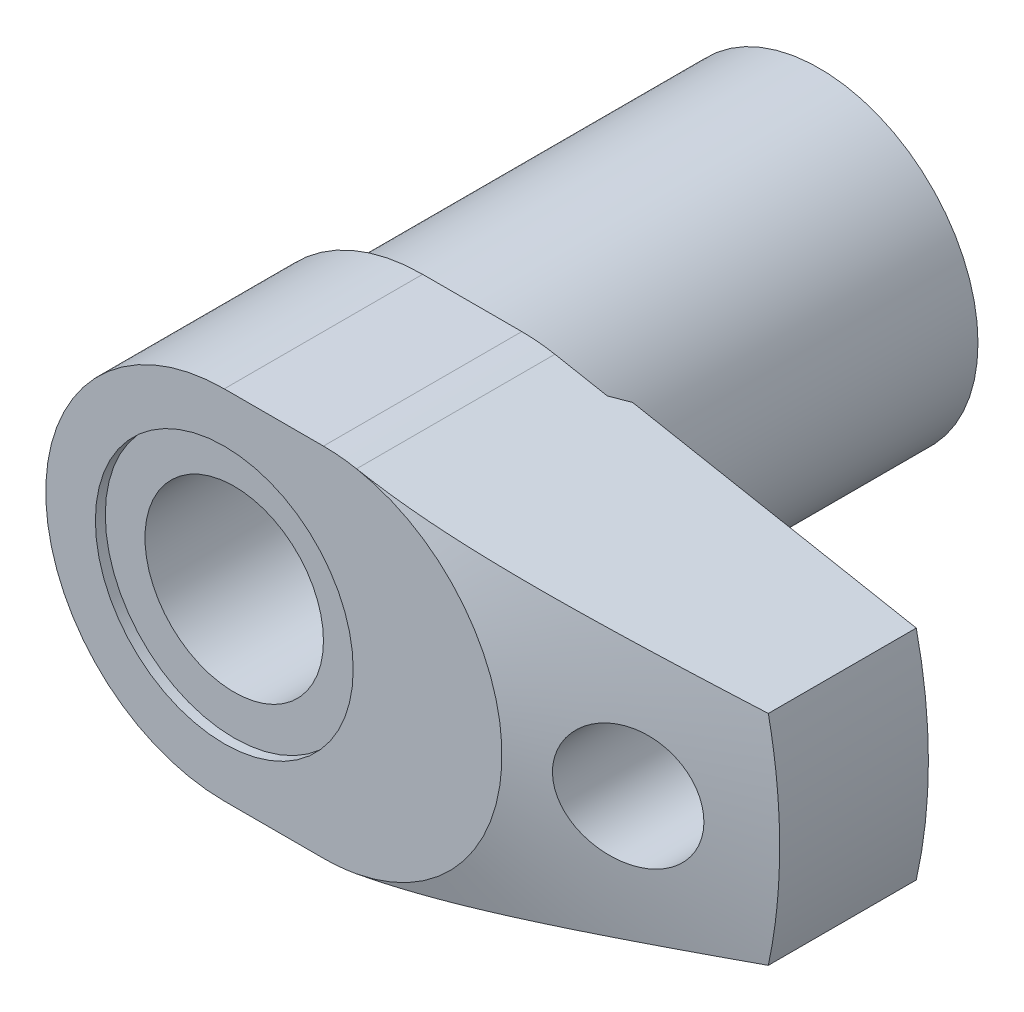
ISO-10303-21;
HEADER;
FILE_DESCRIPTION(('STEP AP214'),'2;1');
FILE_NAME('part.step','',(''),(''),'','','');
FILE_SCHEMA(('AUTOMOTIVE_DESIGN { 1 0 10303 214 1 1 1 1 }'));
ENDSEC;
DATA;
#1=APPLICATION_CONTEXT('core data for automotive mechanical design processes');
#2=APPLICATION_PROTOCOL_DEFINITION('international standard','automotive_design',2000,#1);
#3=PRODUCT_CONTEXT('',#1,'mechanical');
#4=PRODUCT('Part','Part','',(#3));
#5=PRODUCT_RELATED_PRODUCT_CATEGORY('part','',(#4));
#6=PRODUCT_DEFINITION_FORMATION('','',#4);
#7=PRODUCT_DEFINITION_CONTEXT('part definition',#1,'design');
#8=PRODUCT_DEFINITION('design','',#6,#7);
#9=PRODUCT_DEFINITION_SHAPE('','',#8);
#10=(LENGTH_UNIT() NAMED_UNIT(*) SI_UNIT(.MILLI.,.METRE.));
#11=(NAMED_UNIT(*) PLANE_ANGLE_UNIT() SI_UNIT($,.RADIAN.));
#12=(NAMED_UNIT(*) SI_UNIT($,.STERADIAN.) SOLID_ANGLE_UNIT());
#13=UNCERTAINTY_MEASURE_WITH_UNIT(LENGTH_MEASURE(1.E-05),#10,'distance_accuracy_value','');
#14=(GEOMETRIC_REPRESENTATION_CONTEXT(3) GLOBAL_UNCERTAINTY_ASSIGNED_CONTEXT((#13)) GLOBAL_UNIT_ASSIGNED_CONTEXT((#10,
#11,#12)) REPRESENTATION_CONTEXT('',''));
#15=CARTESIAN_POINT('',(0.,0.,0.));
#16=DIRECTION('',(0.,0.,1.));
#17=DIRECTION('',(1.,0.,0.));
#18=AXIS2_PLACEMENT_3D('',#15,#16,#17);
#19=CARTESIAN_POINT('',(48.7749935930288,11.,39.));
#20=DIRECTION('',(0.185449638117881,0.982653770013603,0.));
#21=DIRECTION('',(-0.982653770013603,0.185449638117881,0.));
#22=AXIS2_PLACEMENT_3D('',#19,#20,#21);
#23=PLANE('',#22);
#24=DIRECTION('',(0.,0.,1.));
#25=VECTOR('',#24,1.);
#26=CARTESIAN_POINT('',(13.3380934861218,17.6877678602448,39.));
#27=LINE('',#26,#25);
#28=CARTESIAN_POINT('',(13.3380934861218,17.6877678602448,40.));
#29=VERTEX_POINT('',#28);
#30=CARTESIAN_POINT('',(13.3380934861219,17.6877678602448,60.));
#31=VERTEX_POINT('',#30);
#32=EDGE_CURVE('E117',#29,#31,#27,.T.);
#33=ORIENTED_EDGE('',*,*,#32,.T.);
#34=CARTESIAN_POINT('',(13.3378934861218,17.6878056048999,59.9999999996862));
#35=CARTESIAN_POINT('',(13.7171760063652,17.6162261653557,60.0000170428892));
#36=CARTESIAN_POINT('',(14.0964563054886,17.5446471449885,59.9966168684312));
#37=CARTESIAN_POINT('',(14.8548924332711,17.401512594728,59.9830983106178));
#38=CARTESIAN_POINT('',(15.2340482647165,17.3299570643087,59.9729800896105));
#39=CARTESIAN_POINT('',(15.9920234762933,17.1869094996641,59.9461455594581));
#40=CARTESIAN_POINT('',(16.3708429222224,17.1154174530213,59.9294311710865));
#41=CARTESIAN_POINT('',(17.1281561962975,16.9724948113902,59.8896272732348));
#42=CARTESIAN_POINT('',(17.5066500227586,16.9010642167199,59.8665377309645));
#43=CARTESIAN_POINT('',(18.6401621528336,16.6871440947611,59.7882077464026));
#44=CARTESIAN_POINT('',(19.3945854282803,16.5447668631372,59.7238553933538));
#45=CARTESIAN_POINT('',(20.9013719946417,16.2604011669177,59.5736091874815));
#46=CARTESIAN_POINT('',(21.6537351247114,16.1184127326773,59.4877136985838));
#47=CARTESIAN_POINT('',(23.1538953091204,15.8352975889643,59.2977882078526));
#48=CARTESIAN_POINT('',(23.9016992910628,15.6941695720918,59.1938143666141));
#49=CARTESIAN_POINT('',(25.3950618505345,15.4123372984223,58.9705329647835));
#50=CARTESIAN_POINT('',(26.1406204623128,15.2716330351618,58.8512256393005));
#51=CARTESIAN_POINT('',(27.6300337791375,14.9905460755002,58.5998747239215));
#52=CARTESIAN_POINT('',(28.3738874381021,14.8501635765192,58.4678247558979));
#53=CARTESIAN_POINT('',(29.8597278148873,14.5697509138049,58.1933062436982));
#54=CARTESIAN_POINT('',(30.601714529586,14.4297207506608,58.0508376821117));
#55=CARTESIAN_POINT('',(32.0727292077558,14.1521060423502,57.7595953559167));
#56=CARTESIAN_POINT('',(32.8017820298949,14.0145168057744,57.6109511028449));
#57=CARTESIAN_POINT('',(34.2585048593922,13.7395993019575,57.3068302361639));
#58=CARTESIAN_POINT('',(34.9861748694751,13.6022710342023,57.1513536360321));
#59=CARTESIAN_POINT('',(36.4401757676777,13.327867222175,56.8347765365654));
#60=CARTESIAN_POINT('',(37.1665068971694,13.1907916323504,56.6736771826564));
#61=CARTESIAN_POINT('',(38.6181463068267,12.9168334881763,56.3467724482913));
#62=CARTESIAN_POINT('',(39.3434545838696,12.7799509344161,56.1809670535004));
#63=CARTESIAN_POINT('',(40.7953350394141,12.5059472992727,55.844920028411));
#64=CARTESIAN_POINT('',(41.5219046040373,12.3688267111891,55.674666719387));
#65=CARTESIAN_POINT('',(42.9742806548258,12.0947295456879,55.3308212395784));
#66=CARTESIAN_POINT('',(43.7000871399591,11.957752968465,55.1572290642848));
#67=CARTESIAN_POINT('',(45.1511071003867,11.6839117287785,54.807202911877));
#68=CARTESIAN_POINT('',(45.876320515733,11.5470470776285,54.6307686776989));
#69=CARTESIAN_POINT('',(47.3261685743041,11.2734270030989,54.2754753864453));
#70=CARTESIAN_POINT('',(48.0508032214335,11.1366715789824,54.0966163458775));
#71=CARTESIAN_POINT('',(48.7751935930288,10.9999622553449,53.9167444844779));
#72=B_SPLINE_CURVE_WITH_KNOTS('',3,(#34,#35,#36,#37,#38,#39,#40,#41,#42,#43,#44,#45,#46,#47,#48,
#49,#50,#51,#52,#53,#54,#55,#56,#57,#58,#59,#60,#61,#62,#63,#64,#65,#66,#67,#68,#69,#70,#71),
.UNSPECIFIED.,.F.,.F.,(4,2,2,2,2,2,2,2,2,2,2,2,2,2,2,2,2,2,4),(0.,1.15791456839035,
2.31580115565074,3.47335082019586,4.63090643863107,6.94182118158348,9.25291147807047,
11.5569465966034,13.8609463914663,16.1661054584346,18.4712683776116,20.7412290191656,
23.0111851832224,25.280681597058,27.5501849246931,29.8264061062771,32.1026303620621,
34.3790616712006,36.6554774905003),.UNSPECIFIED.);
#73=CARTESIAN_POINT('',(48.7749935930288,11.,53.9167941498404));
#74=VERTEX_POINT('',#73);
#75=EDGE_CURVE('E95',#31,#74,#72,.T.);
#76=ORIENTED_EDGE('',*,*,#75,.T.);
#77=DIRECTION('',(0.,0.,1.));
#78=VECTOR('',#77,1.);
#79=CARTESIAN_POINT('',(48.7749935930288,11.,39.));
#80=LINE('',#79,#78);
#81=CARTESIAN_POINT('',(48.7749935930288,11.,39.));
#82=VERTEX_POINT('',#81);
#83=EDGE_CURVE('E123',#82,#74,#80,.T.);
#84=ORIENTED_EDGE('',*,*,#83,.F.);
#85=DIRECTION('',(-0.982653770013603,0.185449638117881,0.));
#86=VECTOR('',#85,1.);
#87=CARTESIAN_POINT('',(48.7749935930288,11.,39.));
#88=LINE('',#87,#86);
#89=CARTESIAN_POINT('',(20.1776893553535,16.3969769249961,39.));
#90=VERTEX_POINT('',#89);
#91=EDGE_CURVE('E153',#82,#90,#88,.T.);
#92=ORIENTED_EDGE('',*,*,#91,.T.);
#93=CARTESIAN_POINT('',(18.6102300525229,16.692792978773,40.0002));
#94=CARTESIAN_POINT('',(18.742019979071,16.6679211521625,39.9187004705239));
#95=CARTESIAN_POINT('',(18.873513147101,16.6431053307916,39.8367046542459));
#96=CARTESIAN_POINT('',(19.135917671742,16.5935834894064,39.6717681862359));
#97=CARTESIAN_POINT('',(19.266829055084,16.5688774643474,39.588827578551));
#98=CARTESIAN_POINT('',(19.5280935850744,16.5195707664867,39.4220419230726));
#99=CARTESIAN_POINT('',(19.658446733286,16.4949700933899,39.338196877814));
#100=CARTESIAN_POINT('',(19.9186184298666,16.4458696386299,39.1696385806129));
#101=CARTESIAN_POINT('',(20.0484369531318,16.4213698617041,39.0849252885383));
#102=CARTESIAN_POINT('',(20.1779937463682,16.3969194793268,38.9998));
#103=B_SPLINE_CURVE_WITH_KNOTS('',3,(#93,#94,#95,#96,#97,#98,#99,#100,#101,#102),.UNSPECIFIED.,
.F.,.F.,(4,2,2,2,4),(0.,0.470810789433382,0.94159971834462,1.41238732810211,1.88319679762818),.UNSPECIFIED.);
#104=CARTESIAN_POINT('',(18.6105534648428,16.6927319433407,40.));
#105=VERTEX_POINT('',#104);
#106=EDGE_CURVE('E194',#105,#90,#103,.T.);
#107=ORIENTED_EDGE('',*,*,#106,.F.);
#108=DIRECTION('',(0.982653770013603,-0.185449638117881,0.));
#109=VECTOR('',#108,1.);
#110=CARTESIAN_POINT('',(13.3380934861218,17.6877678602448,40.));
#111=LINE('',#110,#109);
#112=EDGE_CURVE('E119',#29,#105,#111,.T.);
#113=ORIENTED_EDGE('',*,*,#112,.F.);
#114=EDGE_LOOP('',(#33,#76,#84,#92,#107,#113));
#115=FACE_BOUND('',#114,.T.);
#116=ADVANCED_FACE('F14',(#115),#23,.T.);
#117=CARTESIAN_POINT('',(48.7749935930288,-11.,39.));
#118=DIRECTION('',(0.185449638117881,-0.982653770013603,0.));
#119=DIRECTION('',(0.982653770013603,0.185449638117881,0.));
#120=AXIS2_PLACEMENT_3D('',#117,#118,#119);
#121=PLANE('',#120);
#122=DIRECTION('',(0.,0.,1.));
#123=VECTOR('',#122,1.);
#124=CARTESIAN_POINT('',(48.7749935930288,-11.,39.));
#125=LINE('',#124,#123);
#126=CARTESIAN_POINT('',(48.7749935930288,-11.,39.));
#127=VERTEX_POINT('',#126);
#128=CARTESIAN_POINT('',(48.7749935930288,-11.,53.9167941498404));
#129=VERTEX_POINT('',#128);
#130=EDGE_CURVE('E147',#127,#129,#125,.T.);
#131=ORIENTED_EDGE('',*,*,#130,.T.);
#132=CARTESIAN_POINT('',(48.7751935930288,-10.9999622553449,53.9167444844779));
#133=CARTESIAN_POINT('',(48.0465361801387,-11.1374768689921,54.0976756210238));
#134=CARTESIAN_POINT('',(47.3176316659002,-11.2750381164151,54.2775823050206));
#135=CARTESIAN_POINT('',(45.8592364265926,-11.5502712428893,54.6349399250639));
#136=CARTESIAN_POINT('',(45.1297456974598,-11.6879431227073,54.8123908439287));
#137=CARTESIAN_POINT('',(43.670157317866,-11.9634014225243,55.1644128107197));
#138=CARTESIAN_POINT('',(42.9400597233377,-12.1011878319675,55.3389840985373));
#139=CARTESIAN_POINT('',(41.4790904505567,-12.3769067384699,55.6847383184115));
#140=CARTESIAN_POINT('',(40.7482187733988,-12.5148392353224,55.855921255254));
#141=CARTESIAN_POINT('',(39.2877585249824,-12.7904620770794,56.1937556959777));
#142=CARTESIAN_POINT('',(38.5581726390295,-12.9281519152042,56.3604192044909));
#143=CARTESIAN_POINT('',(37.0979614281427,-13.2037277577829,56.6889595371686));
#144=CARTESIAN_POINT('',(36.3673361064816,-13.3416137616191,56.8508363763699));
#145=CARTESIAN_POINT('',(34.9047280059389,-13.6176419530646,57.1688639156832));
#146=CARTESIAN_POINT('',(34.1727449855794,-13.7557841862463,57.3250134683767));
#147=CARTESIAN_POINT('',(32.70737170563,-14.0323342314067,57.630345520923));
#148=CARTESIAN_POINT('',(31.9739814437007,-14.1707420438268,57.7795280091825));
#149=CARTESIAN_POINT('',(30.5028244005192,-14.4483836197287,58.0699756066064));
#150=CARTESIAN_POINT('',(29.7650515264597,-14.5876185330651,58.2112088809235));
#151=CARTESIAN_POINT('',(28.2876513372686,-14.8664383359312,58.4832933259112));
#152=CARTESIAN_POINT('',(27.5480240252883,-15.0060232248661,58.6141445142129));
#153=CARTESIAN_POINT('',(26.0670755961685,-15.2855126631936,58.863159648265));
#154=CARTESIAN_POINT('',(25.3257555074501,-15.4254170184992,58.9813298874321));
#155=CARTESIAN_POINT('',(23.8408933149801,-15.7056450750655,59.2024316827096));
#156=CARTESIAN_POINT('',(23.0973511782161,-15.8459687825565,59.3053630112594));
#157=CARTESIAN_POINT('',(21.6057597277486,-16.1274668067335,59.4933400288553));
#158=CARTESIAN_POINT('',(20.8577035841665,-16.2686424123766,59.5783300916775));
#159=CARTESIAN_POINT('',(19.3595596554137,-16.551377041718,59.7269620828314));
#160=CARTESIAN_POINT('',(18.6094720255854,-16.6929360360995,59.7906055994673));
#161=CARTESIAN_POINT('',(17.4824925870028,-16.9056232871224,59.8680607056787));
#162=CARTESIAN_POINT('',(17.1061863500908,-16.9766410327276,59.8908897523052));
#163=CARTESIAN_POINT('',(16.3532535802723,-17.1187369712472,59.9302421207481));
#164=CARTESIAN_POINT('',(15.9766270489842,-17.1898151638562,59.9467654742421));
#165=CARTESIAN_POINT('',(15.223044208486,-17.3320337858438,59.9732922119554));
#166=CARTESIAN_POINT('',(14.8460878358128,-17.4031742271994,59.9832937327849));
#167=CARTESIAN_POINT('',(14.0920528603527,-17.5454781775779,59.9966560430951));
#168=CARTESIAN_POINT('',(13.7149742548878,-17.6166416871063,60.0000166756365));
#169=CARTESIAN_POINT('',(13.3378934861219,-17.6878056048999,59.9999999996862));
#170=B_SPLINE_CURVE_WITH_KNOTS('',3,(#132,#133,#134,#135,#136,#137,#138,#139,#140,#141,#142,
#143,#144,#145,#146,#147,#148,#149,#150,#151,#152,#153,#154,#155,#156,#157,#158,#159,#160,#161,
#162,#163,#164,#165,#166,#167,#168,#169),.UNSPECIFIED.,.F.,.F.,(4,2,2,2,2,2,2,2,2,2,2,2,2,2,2,2,
2,2,4),(0.,2.28982495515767,4.57966592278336,6.86931515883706,9.15896116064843,11.4417702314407,
13.7245721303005,16.0078289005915,18.2910894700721,20.5829240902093,22.874754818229,
25.165442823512,27.456165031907,29.7538884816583,32.0514409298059,33.2022839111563,
34.3531211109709,35.5042869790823,36.6554800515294),.UNSPECIFIED.);
#171=CARTESIAN_POINT('',(13.3380934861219,-17.6877678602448,60.));
#172=VERTEX_POINT('',#171);
#173=EDGE_CURVE('E35',#129,#172,#170,.T.);
#174=ORIENTED_EDGE('',*,*,#173,.T.);
#175=DIRECTION('',(0.,0.,1.));
#176=VECTOR('',#175,1.);
#177=CARTESIAN_POINT('',(13.3380934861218,-17.6877678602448,39.));
#178=LINE('',#177,#176);
#179=CARTESIAN_POINT('',(13.3380934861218,-17.6877678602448,40.));
#180=VERTEX_POINT('',#179);
#181=EDGE_CURVE('E150',#180,#172,#178,.T.);
#182=ORIENTED_EDGE('',*,*,#181,.F.);
#183=DIRECTION('',(-0.982653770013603,-0.185449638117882,0.));
#184=VECTOR('',#183,1.);
#185=CARTESIAN_POINT('',(18.6105534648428,-16.6927319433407,40.));
#186=LINE('',#185,#184);
#187=CARTESIAN_POINT('',(18.6105534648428,-16.6927319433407,40.));
#188=VERTEX_POINT('',#187);
#189=EDGE_CURVE('E225',#188,#180,#186,.T.);
#190=ORIENTED_EDGE('',*,*,#189,.F.);
#191=CARTESIAN_POINT('',(20.1779937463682,-16.3969194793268,38.9998));
#192=CARTESIAN_POINT('',(20.0484369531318,-16.4213698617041,39.0849252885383));
#193=CARTESIAN_POINT('',(19.9186184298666,-16.4458696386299,39.1696385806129));
#194=CARTESIAN_POINT('',(19.658446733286,-16.4949700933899,39.338196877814));
#195=CARTESIAN_POINT('',(19.5280935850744,-16.5195707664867,39.4220419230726));
#196=CARTESIAN_POINT('',(19.266829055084,-16.5688774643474,39.588827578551));
#197=CARTESIAN_POINT('',(19.135917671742,-16.5935834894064,39.6717681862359));
#198=CARTESIAN_POINT('',(18.873513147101,-16.6431053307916,39.8367046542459));
#199=CARTESIAN_POINT('',(18.742019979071,-16.6679211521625,39.9187004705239));
#200=CARTESIAN_POINT('',(18.6102300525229,-16.692792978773,40.0002));
#201=B_SPLINE_CURVE_WITH_KNOTS('',3,(#191,#192,#193,#194,#195,#196,#197,#198,#199,#200),
.UNSPECIFIED.,.F.,.F.,(4,2,2,2,4),(0.,0.470809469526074,0.941597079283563,1.4123860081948,
1.88319679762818),.UNSPECIFIED.);
#202=CARTESIAN_POINT('',(20.1776893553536,-16.3969769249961,39.));
#203=VERTEX_POINT('',#202);
#204=EDGE_CURVE('E28',#203,#188,#201,.T.);
#205=ORIENTED_EDGE('',*,*,#204,.F.);
#206=DIRECTION('',(0.982653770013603,0.185449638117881,0.));
#207=VECTOR('',#206,1.);
#208=CARTESIAN_POINT('',(48.7749935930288,-11.,39.));
#209=LINE('',#208,#207);
#210=EDGE_CURVE('E137',#203,#127,#209,.T.);
#211=ORIENTED_EDGE('',*,*,#210,.T.);
#212=EDGE_LOOP('',(#131,#174,#182,#190,#205,#211));
#213=FACE_BOUND('',#212,.T.);
#214=ADVANCED_FACE('F182',(#213),#121,.T.);
#215=CARTESIAN_POINT('',(0.,0.,60.));
#216=DIRECTION('',(0.,0.,1.));
#217=DIRECTION('',(1.,0.,0.));
#218=AXIS2_PLACEMENT_3D('',#215,#216,#217);
#219=PLANE('',#218);
#220=CARTESIAN_POINT('',(0.,0.,60.));
#221=DIRECTION('',(0.,0.,1.));
#222=DIRECTION('',(1.,0.,0.));
#223=AXIS2_PLACEMENT_3D('',#220,#221,#222);
#224=CIRCLE('',#223,13.);
#225=CARTESIAN_POINT('',(13.,0.,60.));
#226=VERTEX_POINT('',#225);
#227=EDGE_CURVE('E140',#226,#226,#224,.T.);
#228=ORIENTED_EDGE('',*,*,#227,.F.);
#229=EDGE_LOOP('',(#228));
#230=FACE_BOUND('',#229,.T.);
#231=CARTESIAN_POINT('',(10.,0.,60.));
#232=DIRECTION('',(0.,0.,1.));
#233=DIRECTION('',(1.,0.,0.));
#234=AXIS2_PLACEMENT_3D('',#231,#232,#233);
#235=CIRCLE('',#234,18.);
#236=CARTESIAN_POINT('',(10.,-18.,60.));
#237=VERTEX_POINT('',#236);
#238=EDGE_CURVE('E113',#237,#172,#235,.T.);
#239=ORIENTED_EDGE('',*,*,#238,.T.);
#240=CARTESIAN_POINT('',(10.,0.,60.));
#241=DIRECTION('',(0.,0.,-1.));
#242=DIRECTION('',(-1.,0.,0.));
#243=AXIS2_PLACEMENT_3D('',#240,#241,#242);
#244=CIRCLE('',#243,18.);
#245=EDGE_CURVE('E98',#31,#172,#244,.T.);
#246=ORIENTED_EDGE('',*,*,#245,.F.);
#247=CARTESIAN_POINT('',(10.,0.,60.));
#248=DIRECTION('',(0.,0.,1.));
#249=DIRECTION('',(1.,0.,0.));
#250=AXIS2_PLACEMENT_3D('',#247,#248,#249);
#251=CIRCLE('',#250,18.);
#252=CARTESIAN_POINT('',(10.,18.,60.));
#253=VERTEX_POINT('',#252);
#254=EDGE_CURVE('E110',#31,#253,#251,.T.);
#255=ORIENTED_EDGE('',*,*,#254,.T.);
#256=DIRECTION('',(-1.,0.,0.));
#257=VECTOR('',#256,1.);
#258=CARTESIAN_POINT('',(10.,18.,60.));
#259=LINE('',#258,#257);
#260=CARTESIAN_POINT('',(0.,18.,60.));
#261=VERTEX_POINT('',#260);
#262=EDGE_CURVE('E128',#253,#261,#259,.T.);
#263=ORIENTED_EDGE('',*,*,#262,.T.);
#264=CARTESIAN_POINT('',(0.,0.,60.));
#265=DIRECTION('',(0.,0.,1.));
#266=DIRECTION('',(1.,0.,0.));
#267=AXIS2_PLACEMENT_3D('',#264,#265,#266);
#268=CIRCLE('',#267,18.);
#269=CARTESIAN_POINT('',(0.,-18.,60.));
#270=VERTEX_POINT('',#269);
#271=EDGE_CURVE('E166',#261,#270,#268,.T.);
#272=ORIENTED_EDGE('',*,*,#271,.T.);
#273=DIRECTION('',(1.,0.,0.));
#274=VECTOR('',#273,1.);
#275=CARTESIAN_POINT('',(1.88540101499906E-13,-18.,60.));
#276=LINE('',#275,#274);
#277=EDGE_CURVE('E130',#270,#237,#276,.T.);
#278=ORIENTED_EDGE('',*,*,#277,.T.);
#279=EDGE_LOOP('',(#239,#246,#255,#263,#272,#278));
#280=FACE_BOUND('',#279,.T.);
#281=ADVANCED_FACE('F107',(#230,#280),#219,.T.);
#282=CARTESIAN_POINT('',(0.,0.,39.));
#283=DIRECTION('',(0.,0.,1.));
#284=DIRECTION('',(1.,0.,0.));
#285=AXIS2_PLACEMENT_3D('',#282,#283,#284);
#286=CYLINDRICAL_SURFACE('',#285,50.);
#287=ORIENTED_EDGE('',*,*,#83,.T.);
#288=CARTESIAN_POINT('',(48.7749484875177,11.0002,53.9167910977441));
#289=CARTESIAN_POINT('',(48.9306309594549,10.3099440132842,53.9273259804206));
#290=CARTESIAN_POINT('',(49.0716452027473,9.61637074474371,53.9368824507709));
#291=CARTESIAN_POINT('',(49.324122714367,8.22383261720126,53.9540108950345));
#292=CARTESIAN_POINT('',(49.4355856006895,7.52486768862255,53.9615828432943));
#293=CARTESIAN_POINT('',(49.62878932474,6.12246248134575,53.9747175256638));
#294=CARTESIAN_POINT('',(49.7105155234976,5.41902017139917,53.9802792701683));
#295=CARTESIAN_POINT('',(49.8440224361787,4.00933979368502,53.9893694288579));
#296=CARTESIAN_POINT('',(49.8958036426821,3.3031017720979,53.9928978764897));
#297=CARTESIAN_POINT('',(50.0047161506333,1.20802801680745,54.0003201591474));
#298=CARTESIAN_POINT('',(50.0189880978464,-0.18326917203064,54.0012942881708));
#299=CARTESIAN_POINT('',(49.9315541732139,-2.96142486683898,53.9953338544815));
#300=CARTESIAN_POINT('',(49.8299183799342,-4.34828554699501,53.9884040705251));
#301=CARTESIAN_POINT('',(49.6198783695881,-6.16973049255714,53.9741128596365));
#302=CARTESIAN_POINT('',(49.5630560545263,-6.61068793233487,53.9702481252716));
#303=CARTESIAN_POINT('',(49.4376820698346,-7.49086697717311,53.9617264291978));
#304=CARTESIAN_POINT('',(49.3691325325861,-7.93008888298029,53.9570696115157));
#305=CARTESIAN_POINT('',(49.2199027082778,-8.80915057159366,53.9469394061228));
#306=CARTESIAN_POINT('',(49.1391524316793,-9.24897838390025,53.9414613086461));
#307=CARTESIAN_POINT('',(48.9658705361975,-10.1263788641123,53.9297160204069));
#308=CARTESIAN_POINT('',(48.8733367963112,-10.5639511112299,53.9234486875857));
#309=CARTESIAN_POINT('',(48.7749484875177,-11.0002,53.9167910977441));
#310=B_SPLINE_CURVE_WITH_KNOTS('',3,(#288,#289,#290,#291,#292,#293,#294,#295,#296,#297,#298,
#299,#300,#301,#302,#303,#304,#305,#306,#307,#308,#309),.UNSPECIFIED.,.F.,.F.,(4,2,2,2,2,2,2,2,
2,2,4),(0.,2.12284835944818,4.24572415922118,6.36964361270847,8.49352812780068,12.6625156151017,
16.828983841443,18.1627427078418,19.4962593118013,20.837738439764,22.1794593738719),.UNSPECIFIED.);
#311=EDGE_CURVE('E9',#74,#129,#310,.T.);
#312=ORIENTED_EDGE('',*,*,#311,.T.);
#313=ORIENTED_EDGE('',*,*,#130,.F.);
#314=CARTESIAN_POINT('',(0.,0.,39.));
#315=DIRECTION('',(0.,0.,1.));
#316=DIRECTION('',(1.,0.,0.));
#317=AXIS2_PLACEMENT_3D('',#314,#315,#316);
#318=CIRCLE('',#317,50.);
#319=EDGE_CURVE('E241',#127,#82,#318,.T.);
#320=ORIENTED_EDGE('',*,*,#319,.T.);
#321=EDGE_LOOP('',(#287,#312,#313,#320));
#322=FACE_BOUND('',#321,.T.);
#323=ADVANCED_FACE('F210',(#322),#286,.T.);
#324=CARTESIAN_POINT('',(10.,0.,39.));
#325=DIRECTION('',(0.,0.,1.));
#326=DIRECTION('',(1.,0.,0.));
#327=AXIS2_PLACEMENT_3D('',#324,#325,#326);
#328=CYLINDRICAL_SURFACE('',#327,18.);
#329=DIRECTION('',(0.,0.,1.));
#330=VECTOR('',#329,1.);
#331=CARTESIAN_POINT('',(10.,-18.,39.));
#332=LINE('',#331,#330);
#333=CARTESIAN_POINT('',(10.,-18.,40.));
#334=VERTEX_POINT('',#333);
#335=EDGE_CURVE('E138',#334,#237,#332,.T.);
#336=ORIENTED_EDGE('',*,*,#335,.F.);
#337=CARTESIAN_POINT('',(10.,0.,40.));
#338=DIRECTION('',(0.,0.,-1.));
#339=DIRECTION('',(-1.,0.,0.));
#340=AXIS2_PLACEMENT_3D('',#337,#338,#339);
#341=CIRCLE('',#340,18.);
#342=EDGE_CURVE('E227',#180,#334,#341,.T.);
#343=ORIENTED_EDGE('',*,*,#342,.F.);
#344=ORIENTED_EDGE('',*,*,#181,.T.);
#345=ORIENTED_EDGE('',*,*,#238,.F.);
#346=EDGE_LOOP('',(#336,#343,#344,#345));
#347=FACE_BOUND('',#346,.T.);
#348=ADVANCED_FACE('F279',(#347),#328,.T.);
#349=CARTESIAN_POINT('',(1.88540101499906E-13,-18.,39.));
#350=DIRECTION('',(0.,-1.,0.));
#351=DIRECTION('',(1.,0.,0.));
#352=AXIS2_PLACEMENT_3D('',#349,#350,#351);
#353=PLANE('',#352);
#354=DIRECTION('',(0.,0.,1.));
#355=VECTOR('',#354,1.);
#356=CARTESIAN_POINT('',(1.88540101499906E-13,-18.,39.));
#357=LINE('',#356,#355);
#358=CARTESIAN_POINT('',(0.,-18.,40.));
#359=VERTEX_POINT('',#358);
#360=EDGE_CURVE('E141',#359,#270,#357,.T.);
#361=ORIENTED_EDGE('',*,*,#360,.F.);
#362=DIRECTION('',(-1.,0.,0.));
#363=VECTOR('',#362,1.);
#364=CARTESIAN_POINT('',(10.,-18.,40.));
#365=LINE('',#364,#363);
#366=EDGE_CURVE('E229',#334,#359,#365,.T.);
#367=ORIENTED_EDGE('',*,*,#366,.F.);
#368=ORIENTED_EDGE('',*,*,#335,.T.);
#369=ORIENTED_EDGE('',*,*,#277,.F.);
#370=EDGE_LOOP('',(#361,#367,#368,#369));
#371=FACE_BOUND('',#370,.T.);
#372=ADVANCED_FACE('F256',(#371),#353,.T.);
#373=CARTESIAN_POINT('',(10.,18.,39.));
#374=DIRECTION('',(0.,1.,0.));
#375=DIRECTION('',(-1.,0.,0.));
#376=AXIS2_PLACEMENT_3D('',#373,#374,#375);
#377=PLANE('',#376);
#378=DIRECTION('',(0.,0.,1.));
#379=VECTOR('',#378,1.);
#380=CARTESIAN_POINT('',(10.,18.,39.));
#381=LINE('',#380,#379);
#382=CARTESIAN_POINT('',(10.,18.,40.));
#383=VERTEX_POINT('',#382);
#384=EDGE_CURVE('E122',#383,#253,#381,.T.);
#385=ORIENTED_EDGE('',*,*,#384,.F.);
#386=DIRECTION('',(1.,0.,0.));
#387=VECTOR('',#386,1.);
#388=CARTESIAN_POINT('',(0.,18.,40.));
#389=LINE('',#388,#387);
#390=CARTESIAN_POINT('',(0.,18.,40.));
#391=VERTEX_POINT('',#390);
#392=EDGE_CURVE('E231',#391,#383,#389,.T.);
#393=ORIENTED_EDGE('',*,*,#392,.F.);
#394=DIRECTION('',(0.,0.,1.));
#395=VECTOR('',#394,1.);
#396=CARTESIAN_POINT('',(0.,18.,39.));
#397=LINE('',#396,#395);
#398=EDGE_CURVE('E143',#391,#261,#397,.T.);
#399=ORIENTED_EDGE('',*,*,#398,.T.);
#400=ORIENTED_EDGE('',*,*,#262,.F.);
#401=EDGE_LOOP('',(#385,#393,#399,#400));
#402=FACE_BOUND('',#401,.T.);
#403=ADVANCED_FACE('F259',(#402),#377,.T.);
#404=CARTESIAN_POINT('',(10.,0.,39.));
#405=DIRECTION('',(0.,0.,1.));
#406=DIRECTION('',(1.,0.,0.));
#407=AXIS2_PLACEMENT_3D('',#404,#405,#406);
#408=CYLINDRICAL_SURFACE('',#407,18.);
#409=ORIENTED_EDGE('',*,*,#32,.F.);
#410=CARTESIAN_POINT('',(10.,0.,40.));
#411=DIRECTION('',(0.,0.,-1.));
#412=DIRECTION('',(-1.,0.,0.));
#413=AXIS2_PLACEMENT_3D('',#410,#411,#412);
#414=CIRCLE('',#413,18.);
#415=EDGE_CURVE('E102',#383,#29,#414,.T.);
#416=ORIENTED_EDGE('',*,*,#415,.F.);
#417=ORIENTED_EDGE('',*,*,#384,.T.);
#418=ORIENTED_EDGE('',*,*,#254,.F.);
#419=EDGE_LOOP('',(#409,#416,#417,#418));
#420=FACE_BOUND('',#419,.T.);
#421=ADVANCED_FACE('F125',(#420),#408,.T.);
#422=CARTESIAN_POINT('',(0.,0.,60.));
#423=DIRECTION('',(0.,0.,-1.));
#424=DIRECTION('',(-1.,0.,0.));
#425=AXIS2_PLACEMENT_3D('',#422,#423,#424);
#426=CYLINDRICAL_SURFACE('',#425,18.);
#427=CARTESIAN_POINT('',(0.,0.,40.));
#428=DIRECTION('',(0.,0.,1.));
#429=DIRECTION('',(1.,0.,0.));
#430=AXIS2_PLACEMENT_3D('',#427,#428,#429);
#431=CIRCLE('',#430,18.);
#432=EDGE_CURVE('E202',#391,#359,#431,.T.);
#433=ORIENTED_EDGE('',*,*,#432,.T.);
#434=ORIENTED_EDGE('',*,*,#360,.T.);
#435=ORIENTED_EDGE('',*,*,#271,.F.);
#436=ORIENTED_EDGE('',*,*,#398,.F.);
#437=EDGE_LOOP('',(#433,#434,#435,#436));
#438=FACE_BOUND('',#437,.T.);
#439=ADVANCED_FACE('F16',(#438),#426,.T.);
#440=CARTESIAN_POINT('',(60.,20.,39.));
#441=DIRECTION('',(0.,0.,1.));
#442=DIRECTION('',(1.,0.,0.));
#443=AXIS2_PLACEMENT_3D('',#440,#441,#442);
#444=PLANE('',#443);
#445=CARTESIAN_POINT('',(38.,0.,39.));
#446=DIRECTION('',(0.,0.,-1.));
#447=DIRECTION('',(-1.,0.,0.));
#448=AXIS2_PLACEMENT_3D('',#445,#446,#447);
#449=CIRCLE('',#448,6.);
#450=CARTESIAN_POINT('',(32.,0.,39.));
#451=VERTEX_POINT('',#450);
#452=EDGE_CURVE('E410',#451,#451,#449,.T.);
#453=ORIENTED_EDGE('',*,*,#452,.F.);
#454=EDGE_LOOP('',(#453));
#455=FACE_BOUND('',#454,.T.);
#456=ORIENTED_EDGE('',*,*,#210,.F.);
#457=CARTESIAN_POINT('',(0.,0.,39.));
#458=DIRECTION('',(0.,0.,1.));
#459=DIRECTION('',(1.,0.,0.));
#460=AXIS2_PLACEMENT_3D('',#457,#458,#459);
#461=CIRCLE('',#460,26.);
#462=EDGE_CURVE('E42',#203,#90,#461,.T.);
#463=ORIENTED_EDGE('',*,*,#462,.T.);
#464=ORIENTED_EDGE('',*,*,#91,.F.);
#465=ORIENTED_EDGE('',*,*,#319,.F.);
#466=EDGE_LOOP('',(#456,#463,#464,#465));
#467=FACE_BOUND('',#466,.T.);
#468=ADVANCED_FACE('F285',(#455,#467),#444,.F.);
#469=CARTESIAN_POINT('',(0.,0.,60.));
#470=DIRECTION('',(0.,0.,-1.));
#471=DIRECTION('',(-1.,0.,0.));
#472=AXIS2_PLACEMENT_3D('',#469,#470,#471);
#473=CYLINDRICAL_SURFACE('',#472,9.);
#474=CARTESIAN_POINT('',(0.,0.,0.));
#475=DIRECTION('',(0.,0.,1.));
#476=DIRECTION('',(1.,0.,0.));
#477=AXIS2_PLACEMENT_3D('',#474,#475,#476);
#478=CIRCLE('',#477,9.);
#479=CARTESIAN_POINT('',(9.,0.,0.));
#480=VERTEX_POINT('',#479);
#481=EDGE_CURVE('E163',#480,#480,#478,.T.);
#482=ORIENTED_EDGE('',*,*,#481,.F.);
#483=EDGE_LOOP('',(#482));
#484=FACE_BOUND('',#483,.T.);
#485=CARTESIAN_POINT('',(0.,0.,59.));
#486=DIRECTION('',(0.,0.,1.));
#487=DIRECTION('',(1.,0.,0.));
#488=AXIS2_PLACEMENT_3D('',#485,#486,#487);
#489=CIRCLE('',#488,9.);
#490=CARTESIAN_POINT('',(9.,0.,59.));
#491=VERTEX_POINT('',#490);
#492=EDGE_CURVE('E157',#491,#491,#489,.T.);
#493=ORIENTED_EDGE('',*,*,#492,.T.);
#494=EDGE_LOOP('',(#493));
#495=FACE_BOUND('',#494,.T.);
#496=ADVANCED_FACE('F288',(#484,#495),#473,.F.);
#497=CARTESIAN_POINT('',(0.,0.,0.));
#498=DIRECTION('',(0.,0.,1.));
#499=DIRECTION('',(1.,0.,0.));
#500=AXIS2_PLACEMENT_3D('',#497,#498,#499);
#501=PLANE('',#500);
#502=ORIENTED_EDGE('',*,*,#481,.T.);
#503=EDGE_LOOP('',(#502));
#504=FACE_BOUND('',#503,.T.);
#505=CARTESIAN_POINT('',(0.,0.,0.));
#506=DIRECTION('',(0.,0.,-1.));
#507=DIRECTION('',(-1.,0.,0.));
#508=AXIS2_PLACEMENT_3D('',#505,#506,#507);
#509=CIRCLE('',#508,16.);
#510=CARTESIAN_POINT('',(-16.,0.,0.));
#511=VERTEX_POINT('',#510);
#512=EDGE_CURVE('E160',#511,#511,#509,.T.);
#513=ORIENTED_EDGE('',*,*,#512,.T.);
#514=EDGE_LOOP('',(#513));
#515=FACE_BOUND('',#514,.T.);
#516=ADVANCED_FACE('F283',(#504,#515),#501,.F.);
#517=CARTESIAN_POINT('',(0.,0.,39.));
#518=DIRECTION('',(0.,0.,-1.));
#519=DIRECTION('',(-1.,0.,0.));
#520=AXIS2_PLACEMENT_3D('',#517,#518,#519);
#521=CYLINDRICAL_SURFACE('',#520,16.);
#522=ORIENTED_EDGE('',*,*,#512,.F.);
#523=EDGE_LOOP('',(#522));
#524=FACE_BOUND('',#523,.T.);
#525=CARTESIAN_POINT('',(0.,0.,40.));
#526=DIRECTION('',(0.,0.,1.));
#527=DIRECTION('',(1.,0.,0.));
#528=AXIS2_PLACEMENT_3D('',#525,#526,#527);
#529=CIRCLE('',#528,16.);
#530=CARTESIAN_POINT('',(16.,0.,40.));
#531=VERTEX_POINT('',#530);
#532=EDGE_CURVE('E132',#531,#531,#529,.T.);
#533=ORIENTED_EDGE('',*,*,#532,.F.);
#534=EDGE_LOOP('',(#533));
#535=FACE_BOUND('',#534,.T.);
#536=ADVANCED_FACE('F274',(#524,#535),#521,.T.);
#537=CARTESIAN_POINT('',(0.,0.,59.));
#538=DIRECTION('',(0.,0.,1.));
#539=DIRECTION('',(1.,0.,0.));
#540=AXIS2_PLACEMENT_3D('',#537,#538,#539);
#541=CYLINDRICAL_SURFACE('',#540,13.);
#542=CARTESIAN_POINT('',(0.,0.,59.));
#543=DIRECTION('',(0.,0.,1.));
#544=DIRECTION('',(1.,0.,0.));
#545=AXIS2_PLACEMENT_3D('',#542,#543,#544);
#546=CIRCLE('',#545,13.);
#547=CARTESIAN_POINT('',(13.,0.,59.));
#548=VERTEX_POINT('',#547);
#549=EDGE_CURVE('E154',#548,#548,#546,.T.);
#550=ORIENTED_EDGE('',*,*,#549,.F.);
#551=EDGE_LOOP('',(#550));
#552=FACE_BOUND('',#551,.T.);
#553=ORIENTED_EDGE('',*,*,#227,.T.);
#554=EDGE_LOOP('',(#553));
#555=FACE_BOUND('',#554,.T.);
#556=ADVANCED_FACE('F267',(#552,#555),#541,.F.);
#557=CARTESIAN_POINT('',(0.,0.,59.));
#558=DIRECTION('',(0.,0.,1.));
#559=DIRECTION('',(1.,0.,0.));
#560=AXIS2_PLACEMENT_3D('',#557,#558,#559);
#561=PLANE('',#560);
#562=ORIENTED_EDGE('',*,*,#492,.F.);
#563=EDGE_LOOP('',(#562));
#564=FACE_BOUND('',#563,.T.);
#565=ORIENTED_EDGE('',*,*,#549,.T.);
#566=EDGE_LOOP('',(#565));
#567=FACE_BOUND('',#566,.T.);
#568=ADVANCED_FACE('F261',(#564,#567),#561,.T.);
#569=CARTESIAN_POINT('',(-16.,0.,40.));
#570=DIRECTION('',(0.,0.,-1.));
#571=DIRECTION('',(-1.,0.,0.));
#572=AXIS2_PLACEMENT_3D('',#569,#570,#571);
#573=PLANE('',#572);
#574=ORIENTED_EDGE('',*,*,#532,.T.);
#575=EDGE_LOOP('',(#574));
#576=FACE_BOUND('',#575,.T.);
#577=ORIENTED_EDGE('',*,*,#432,.F.);
#578=ORIENTED_EDGE('',*,*,#392,.T.);
#579=ORIENTED_EDGE('',*,*,#415,.T.);
#580=ORIENTED_EDGE('',*,*,#112,.T.);
#581=CARTESIAN_POINT('',(0.,0.,40.));
#582=DIRECTION('',(0.,0.,1.));
#583=DIRECTION('',(1.,0.,0.));
#584=AXIS2_PLACEMENT_3D('',#581,#582,#583);
#585=CIRCLE('',#584,25.);
#586=EDGE_CURVE('E203',#188,#105,#585,.T.);
#587=ORIENTED_EDGE('',*,*,#586,.F.);
#588=ORIENTED_EDGE('',*,*,#189,.T.);
#589=ORIENTED_EDGE('',*,*,#342,.T.);
#590=ORIENTED_EDGE('',*,*,#366,.T.);
#591=EDGE_LOOP('',(#577,#578,#579,#580,#587,#588,#589,#590));
#592=FACE_BOUND('',#591,.T.);
#593=ADVANCED_FACE('F189',(#576,#592),#573,.T.);
#594=CARTESIAN_POINT('',(0.,0.,40.));
#595=DIRECTION('',(0.,0.,-1.));
#596=DIRECTION('',(-1.,0.,0.));
#597=AXIS2_PLACEMENT_3D('',#594,#595,#596);
#598=CONICAL_SURFACE('',#597,25.,0.785398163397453);
#599=ORIENTED_EDGE('',*,*,#106,.T.);
#600=ORIENTED_EDGE('',*,*,#462,.F.);
#601=ORIENTED_EDGE('',*,*,#204,.T.);
#602=ORIENTED_EDGE('',*,*,#586,.T.);
#603=EDGE_LOOP('',(#599,#600,#601,#602));
#604=FACE_BOUND('',#603,.T.);
#605=ADVANCED_FACE('F185',(#604),#598,.F.);
#606=CARTESIAN_POINT('',(10.,0.,50.3000850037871));
#607=DIRECTION('',(0.,0.,-1.));
#608=DIRECTION('',(-1.,0.,0.));
#609=AXIS2_PLACEMENT_3D('',#606,#607,#608);
#610=CONICAL_SURFACE('',#609,53.5663549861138,1.30454427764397);
#611=CARTESIAN_POINT('',(33.7343700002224,-4.21952770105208,58.3345818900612));
#612=CARTESIAN_POINT('',(33.8568669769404,-4.34336326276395,58.2957778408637));
#613=CARTESIAN_POINT('',(33.9845517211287,-4.46165084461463,58.2556758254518));
#614=CARTESIAN_POINT('',(34.2493384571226,-4.68643847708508,58.1733030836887));
#615=CARTESIAN_POINT('',(34.3864438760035,-4.79293420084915,58.1310315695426));
#616=CARTESIAN_POINT('',(34.6691719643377,-4.99356306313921,58.0447089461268));
#617=CARTESIAN_POINT('',(34.8148054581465,-5.08767997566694,58.0006555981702));
#618=CARTESIAN_POINT('',(35.1134144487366,-5.26285075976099,57.9112146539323));
#619=CARTESIAN_POINT('',(35.2663927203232,-5.34389964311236,57.8658265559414));
#620=CARTESIAN_POINT('',(35.5782491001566,-5.49225660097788,57.7742091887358));
#621=CARTESIAN_POINT('',(35.7371155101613,-5.5595903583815,57.727981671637));
#622=CARTESIAN_POINT('',(36.0599671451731,-5.68031559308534,57.6349516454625));
#623=CARTESIAN_POINT('',(36.2239542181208,-5.73370197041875,57.5881489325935));
#624=CARTESIAN_POINT('',(36.5557377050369,-5.82612570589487,57.4943648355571));
#625=CARTESIAN_POINT('',(36.7235313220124,-5.86517325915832,57.4473836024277));
#626=CARTESIAN_POINT('',(37.061946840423,-5.92871893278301,57.35351836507));
#627=CARTESIAN_POINT('',(37.2325697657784,-5.95321166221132,57.306634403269));
#628=CARTESIAN_POINT('',(37.5777921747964,-5.98767469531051,57.2126399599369));
#629=CARTESIAN_POINT('',(37.7524139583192,-5.99743824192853,57.1655353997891));
#630=CARTESIAN_POINT('',(38.1021072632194,-6.0016798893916,57.0720488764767));
#631=CARTESIAN_POINT('',(38.2771789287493,-5.99615225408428,57.0256671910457));
#632=CARTESIAN_POINT('',(38.6263881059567,-5.96978133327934,56.9339466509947));
#633=CARTESIAN_POINT('',(38.8005258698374,-5.94894241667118,56.8886075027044));
#634=CARTESIAN_POINT('',(39.1466980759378,-5.89201695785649,56.7992164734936));
#635=CARTESIAN_POINT('',(39.3187317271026,-5.85592485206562,56.7551650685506));
#636=CARTESIAN_POINT('',(39.6581940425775,-5.76895856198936,56.6689185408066));
#637=CARTESIAN_POINT('',(39.8256458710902,-5.71818525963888,56.6267129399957));
#638=CARTESIAN_POINT('',(40.1559241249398,-5.60202235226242,56.5440749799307));
#639=CARTESIAN_POINT('',(40.3187487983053,-5.53662729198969,56.5036432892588));
#640=CARTESIAN_POINT('',(40.63838696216,-5.39162989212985,56.424815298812));
#641=CARTESIAN_POINT('',(40.7952031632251,-5.31203405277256,56.3864180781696));
#642=CARTESIAN_POINT('',(41.1016484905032,-5.13914485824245,56.311859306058));
#643=CARTESIAN_POINT('',(41.2512750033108,-5.0458465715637,56.275698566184));
#644=CARTESIAN_POINT('',(41.6809182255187,-4.75071474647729,56.1724739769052));
#645=CARTESIAN_POINT('',(41.9493603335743,-4.53015653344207,56.1087872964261));
#646=CARTESIAN_POINT('',(42.3209669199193,-4.16647115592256,56.0214215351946));
#647=CARTESIAN_POINT('',(42.4397006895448,-4.03971110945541,55.993650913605));
#648=CARTESIAN_POINT('',(42.6660211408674,-3.77603133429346,55.9409386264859));
#649=CARTESIAN_POINT('',(42.7736077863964,-3.63911157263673,55.9159969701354));
#650=CARTESIAN_POINT('',(43.072493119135,-3.22245467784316,55.8469596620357));
#651=CARTESIAN_POINT('',(43.2471037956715,-2.92975503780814,55.8069711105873));
#652=CARTESIAN_POINT('',(43.544587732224,-2.31804392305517,55.7391562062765));
#653=CARTESIAN_POINT('',(43.6674683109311,-1.99903617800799,55.711328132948));
#654=CARTESIAN_POINT('',(43.8552629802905,-1.35159487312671,55.6689047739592));
#655=CARTESIAN_POINT('',(43.921457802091,-1.02355264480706,55.6540169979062));
#656=CARTESIAN_POINT('',(43.9984320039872,-0.360725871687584,55.6367116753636));
#657=CARTESIAN_POINT('',(44.0092162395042,-0.0259419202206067,55.6342930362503));
#658=CARTESIAN_POINT('',(43.9752403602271,0.636528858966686,55.641925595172));
#659=CARTESIAN_POINT('',(43.9311574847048,0.964252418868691,55.6518247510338));
#660=CARTESIAN_POINT('',(43.7900304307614,1.6074695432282,55.6836294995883));
#661=CARTESIAN_POINT('',(43.6929870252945,1.92296328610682,55.7055349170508));
#662=CARTESIAN_POINT('',(43.4488522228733,2.53342745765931,55.7609464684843));
#663=CARTESIAN_POINT('',(43.3016812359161,2.82836434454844,55.7944710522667));
#664=CARTESIAN_POINT('',(42.9619404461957,3.38919707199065,55.8724339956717));
#665=CARTESIAN_POINT('',(42.769368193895,3.65509134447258,55.9168729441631));
#666=CARTESIAN_POINT('',(42.3415351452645,4.15461181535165,56.0165097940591));
#667=CARTESIAN_POINT('',(42.1056882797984,4.3877060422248,56.0718562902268));
#668=CARTESIAN_POINT('',(41.6003176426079,4.81106956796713,56.1917697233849));
#669=CARTESIAN_POINT('',(41.3307902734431,5.00133428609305,56.2563376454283));
#670=CARTESIAN_POINT('',(40.7590294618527,5.33859609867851,56.3950545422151));
#671=CARTESIAN_POINT('',(40.4561648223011,5.48444119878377,56.4693967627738));
#672=CARTESIAN_POINT('',(39.83175401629,5.72331290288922,56.624916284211));
#673=CARTESIAN_POINT('',(39.5102053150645,5.81633232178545,56.7060945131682));
#674=CARTESIAN_POINT('',(39.0164939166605,5.91574859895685,56.8327311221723));
#675=CARTESIAN_POINT('',(38.8476662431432,5.94227348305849,56.8763785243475));
#676=CARTESIAN_POINT('',(38.5086613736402,5.98082910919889,56.9647592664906));
#677=CARTESIAN_POINT('',(38.3384846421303,5.99286463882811,57.0094922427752));
#678=CARTESIAN_POINT('',(37.9978780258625,6.00242027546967,57.0998055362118));
#679=CARTESIAN_POINT('',(37.8274480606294,5.99993369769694,57.1453862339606));
#680=CARTESIAN_POINT('',(37.4876228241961,5.98050336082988,57.2370874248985));
#681=CARTESIAN_POINT('',(37.3182272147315,5.96356461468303,57.2832077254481));
#682=CARTESIAN_POINT('',(36.9778900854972,5.91485268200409,57.3767217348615));
#683=CARTESIAN_POINT('',(36.8069951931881,5.8827645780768,57.4241213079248));
#684=CARTESIAN_POINT('',(36.4686802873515,5.80389687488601,57.5188548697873));
#685=CARTESIAN_POINT('',(36.3012590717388,5.7571224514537,57.5661888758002));
#686=CARTESIAN_POINT('',(35.9709281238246,5.64916580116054,57.6604849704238));
#687=CARTESIAN_POINT('',(35.8080204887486,5.58797699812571,57.707446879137));
#688=CARTESIAN_POINT('',(35.4880114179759,5.45161919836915,57.8005928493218));
#689=CARTESIAN_POINT('',(35.3309078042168,5.37645551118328,57.8467771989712));
#690=CARTESIAN_POINT('',(35.022730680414,5.21215169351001,57.9382480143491));
#691=CARTESIAN_POINT('',(34.8716947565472,5.12293752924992,57.9835282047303));
#692=CARTESIAN_POINT('',(34.5777487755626,4.93142520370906,58.0724947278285));
#693=CARTESIAN_POINT('',(34.4348355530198,4.82913219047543,58.1161816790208));
#694=CARTESIAN_POINT('',(34.1581127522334,4.61203220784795,58.2015587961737));
#695=CARTESIAN_POINT('',(34.0243067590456,4.49722035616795,58.243248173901));
#696=CARTESIAN_POINT('',(33.7669831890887,4.25589790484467,58.3241359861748));
#697=CARTESIAN_POINT('',(33.643461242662,4.12939232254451,58.3633354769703));
#698=CARTESIAN_POINT('',(33.4101006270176,3.86818593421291,58.4380134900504));
#699=CARTESIAN_POINT('',(33.3000330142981,3.73370683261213,58.4735519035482));
#700=CARTESIAN_POINT('',(33.0916730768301,3.45522133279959,58.5413375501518));
#701=CARTESIAN_POINT('',(32.9933759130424,3.3112188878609,58.5735861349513));
#702=CARTESIAN_POINT('',(32.8093872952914,3.01462981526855,58.6343593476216));
#703=CARTESIAN_POINT('',(32.7236955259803,2.86204340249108,58.6628840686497));
#704=CARTESIAN_POINT('',(32.5657292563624,2.54938695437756,58.715777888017));
#705=CARTESIAN_POINT('',(32.4934541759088,2.38931724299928,58.7401471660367));
#706=CARTESIAN_POINT('',(32.3660233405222,2.07037142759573,58.7833225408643));
#707=CARTESIAN_POINT('',(32.3102363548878,1.91177485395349,58.8023319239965));
#708=CARTESIAN_POINT('',(32.2120732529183,1.59002800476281,58.8359015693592));
#709=CARTESIAN_POINT('',(32.1696964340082,1.42687796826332,58.8504620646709));
#710=CARTESIAN_POINT('',(32.0987855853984,1.09730226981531,58.8748867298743));
#711=CARTESIAN_POINT('',(32.0702473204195,0.930877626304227,58.8847523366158));
#712=CARTESIAN_POINT('',(32.0272891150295,0.596001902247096,58.8996214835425));
#713=CARTESIAN_POINT('',(32.0128687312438,0.427550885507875,58.9046251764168));
#714=CARTESIAN_POINT('',(31.998625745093,0.0976095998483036,58.9095674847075));
#715=CARTESIAN_POINT('',(31.998171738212,-0.0638504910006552,58.9097251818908));
#716=CARTESIAN_POINT('',(32.0102736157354,-0.386279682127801,58.9055255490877));
#717=CARTESIAN_POINT('',(32.0228338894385,-0.547248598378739,58.9011666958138));
#718=CARTESIAN_POINT('',(32.0608466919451,-0.867435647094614,58.8880040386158));
#719=CARTESIAN_POINT('',(32.0862964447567,-1.02665414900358,58.8792011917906));
#720=CARTESIAN_POINT('',(32.149860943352,-1.34231334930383,58.8572867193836));
#721=CARTESIAN_POINT('',(32.1879813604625,-1.49875277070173,58.8441731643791));
#722=CARTESIAN_POINT('',(32.2761696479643,-1.80642343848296,58.8139656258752));
#723=CARTESIAN_POINT('',(32.3261366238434,-1.95768694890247,58.7969052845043));
#724=CARTESIAN_POINT('',(32.4377479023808,-2.25535340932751,58.7589928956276));
#725=CARTESIAN_POINT('',(32.4993925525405,-2.40175621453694,58.7381407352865));
#726=CARTESIAN_POINT('',(32.6337810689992,-2.68863517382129,58.6929513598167));
#727=CARTESIAN_POINT('',(32.7065139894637,-2.82911700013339,58.6686175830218));
#728=CARTESIAN_POINT('',(32.8625229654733,-3.103421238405,58.616767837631));
#729=CARTESIAN_POINT('',(32.9457962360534,-3.23724539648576,58.5892527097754));
#730=CARTESIAN_POINT('',(33.1377600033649,-3.52033548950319,58.5262815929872));
#731=CARTESIAN_POINT('',(33.2483474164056,-3.66819820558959,58.4902789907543));
#732=CARTESIAN_POINT('',(33.4821630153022,-3.9525998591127,58.4148578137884));
#733=CARTESIAN_POINT('',(33.6053908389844,-4.08913912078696,58.3754393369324));
#734=CARTESIAN_POINT('',(33.7343700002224,-4.21952770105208,58.3345818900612));
#735=B_SPLINE_CURVE_WITH_KNOTS('',3,(#611,#612,#613,#614,#615,#616,#617,#618,#619,#620,#621,
#622,#623,#624,#625,#626,#627,#628,#629,#630,#631,#632,#633,#634,#635,#636,#637,#638,#639,#640,
#641,#642,#643,#644,#645,#646,#647,#648,#649,#650,#651,#652,#653,#654,#655,#656,#657,#658,#659,
#660,#661,#662,#663,#664,#665,#666,#667,#668,#669,#670,#671,#672,#673,#674,#675,#676,#677,#678,
#679,#680,#681,#682,#683,#684,#685,#686,#687,#688,#689,#690,#691,#692,#693,#694,#695,#696,#697,
#698,#699,#700,#701,#702,#703,#704,#705,#706,#707,#708,#709,#710,#711,#712,#713,#714,#715,#716,
#717,#718,#719,#720,#721,#722,#723,#724,#725,#726,#727,#728,#729,#730,#731,#732,#733,#734),
.UNSPECIFIED.,.T.,.F.,(4,2,2,2,2,2,2,2,2,2,2,2,2,2,2,2,2,2,2,2,2,2,2,2,2,2,2,2,2,2,2,2,2,2,2,2,
2,2,2,2,2,2,2,2,2,2,2,2,2,2,2,2,2,2,2,2,2,2,2,2,2,4),(0.,0.535194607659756,1.07058495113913,
1.60667022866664,2.14295965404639,2.67823540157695,3.21370660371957,3.74879633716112,
4.28408413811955,4.82681818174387,5.36975584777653,5.91253865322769,6.45551960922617,
6.99485470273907,7.53439135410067,8.07368166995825,8.6131665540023,9.66658639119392,
10.1937154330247,10.7208461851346,11.7448716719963,12.7687522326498,13.7688386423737,
14.7688374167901,15.7566144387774,16.744377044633,17.7337153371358,18.7231070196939,
19.7270470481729,20.7310944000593,21.7593151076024,22.7876756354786,23.3163279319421,
23.8448055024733,24.3735263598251,24.9020638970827,25.4421076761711,25.9819613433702,
26.5220617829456,27.0619574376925,27.6047994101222,28.147428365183,28.6902697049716,
29.2328792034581,29.7643433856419,30.2955883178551,30.826819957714,31.3580286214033,
31.86496997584,32.371884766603,32.8786443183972,33.3853879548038,33.8691868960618,
34.3531490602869,34.8370070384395,35.3210818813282,35.8011733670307,36.2812791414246,
36.7609140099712,37.2404224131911,37.8039541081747,38.3674696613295),.UNSPECIFIED.);
#736=CARTESIAN_POINT('',(33.7343700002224,-4.21952770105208,58.3345818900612));
#737=VERTEX_POINT('',#736);
#738=EDGE_CURVE('E18',#737,#737,#735,.T.);
#739=ORIENTED_EDGE('',*,*,#738,.F.);
#740=EDGE_LOOP('',(#739));
#741=FACE_BOUND('',#740,.T.);
#742=ORIENTED_EDGE('',*,*,#245,.T.);
#743=ORIENTED_EDGE('',*,*,#173,.F.);
#744=ORIENTED_EDGE('',*,*,#311,.F.);
#745=ORIENTED_EDGE('',*,*,#75,.F.);
#746=EDGE_LOOP('',(#742,#743,#744,#745));
#747=FACE_BOUND('',#746,.T.);
#748=ADVANCED_FACE('F97',(#741,#747),#610,.T.);
#749=CARTESIAN_POINT('',(38.,0.,60.));
#750=DIRECTION('',(0.,0.,-1.));
#751=DIRECTION('',(-1.,0.,0.));
#752=AXIS2_PLACEMENT_3D('',#749,#750,#751);
#753=CYLINDRICAL_SURFACE('',#752,6.);
#754=ORIENTED_EDGE('',*,*,#738,.T.);
#755=EDGE_LOOP('',(#754));
#756=FACE_BOUND('',#755,.T.);
#757=ORIENTED_EDGE('',*,*,#452,.T.);
#758=EDGE_LOOP('',(#757));
#759=FACE_BOUND('',#758,.T.);
#760=ADVANCED_FACE('F392',(#756,#759),#753,.F.);
#761=CLOSED_SHELL('',(#116,#214,#281,#323,#348,#372,#403,#421,#439,#468,#496,#516,#536,#556,
#568,#593,#605,#748,#760));
#762=MANIFOLD_SOLID_BREP('B1',#761);
#763=ADVANCED_BREP_SHAPE_REPRESENTATION('',(#18,#762),#14);
#764=SHAPE_DEFINITION_REPRESENTATION(#9,#763);
ENDSEC;
END-ISO-10303-21;
